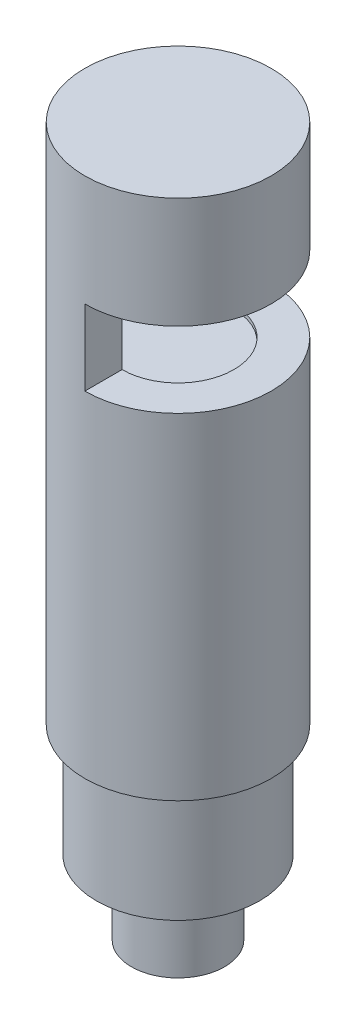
ISO-10303-21;
HEADER;
FILE_DESCRIPTION(('STEP AP214'),'2;1');
FILE_NAME('part.step','',(''),(''),'','','');
FILE_SCHEMA(('AUTOMOTIVE_DESIGN { 1 0 10303 214 1 1 1 1 }'));
ENDSEC;
DATA;
#1=APPLICATION_CONTEXT('core data for automotive mechanical design processes');
#2=APPLICATION_PROTOCOL_DEFINITION('international standard','automotive_design',2000,#1);
#3=PRODUCT_CONTEXT('',#1,'mechanical');
#4=PRODUCT('Part','Part','',(#3));
#5=PRODUCT_RELATED_PRODUCT_CATEGORY('part','',(#4));
#6=PRODUCT_DEFINITION_FORMATION('','',#4);
#7=PRODUCT_DEFINITION_CONTEXT('part definition',#1,'design');
#8=PRODUCT_DEFINITION('design','',#6,#7);
#9=PRODUCT_DEFINITION_SHAPE('','',#8);
#10=(LENGTH_UNIT() NAMED_UNIT(*) SI_UNIT(.MILLI.,.METRE.));
#11=(NAMED_UNIT(*) PLANE_ANGLE_UNIT() SI_UNIT($,.RADIAN.));
#12=(NAMED_UNIT(*) SI_UNIT($,.STERADIAN.) SOLID_ANGLE_UNIT());
#13=UNCERTAINTY_MEASURE_WITH_UNIT(LENGTH_MEASURE(1.E-05),#10,'distance_accuracy_value','');
#14=(GEOMETRIC_REPRESENTATION_CONTEXT(3) GLOBAL_UNCERTAINTY_ASSIGNED_CONTEXT((#13)) GLOBAL_UNIT_ASSIGNED_CONTEXT((#10,
#11,#12)) REPRESENTATION_CONTEXT('',''));
#15=CARTESIAN_POINT('',(0.,0.,0.));
#16=DIRECTION('',(0.,0.,1.));
#17=DIRECTION('',(1.,0.,0.));
#18=AXIS2_PLACEMENT_3D('',#15,#16,#17);
#19=CARTESIAN_POINT('',(0.,-7.61999999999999,0.));
#20=DIRECTION('',(0.,-1.,0.));
#21=DIRECTION('',(0.,0.,-1.));
#22=AXIS2_PLACEMENT_3D('',#19,#20,#21);
#23=PLANE('',#22);
#24=CARTESIAN_POINT('',(0.,-7.61999999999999,0.));
#25=DIRECTION('',(0.,-1.,0.));
#26=DIRECTION('',(0.,0.,-1.));
#27=AXIS2_PLACEMENT_3D('',#24,#25,#26);
#28=CIRCLE('',#27,5.55625);
#29=CARTESIAN_POINT('',(0.,-7.62,5.55625));
#30=VERTEX_POINT('',#29);
#31=EDGE_CURVE('E125',#30,#30,#28,.T.);
#32=ORIENTED_EDGE('',*,*,#31,.T.);
#33=EDGE_LOOP('',(#32));
#34=FACE_BOUND('',#33,.T.);
#35=CARTESIAN_POINT('',(0.,-7.61999999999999,0.));
#36=DIRECTION('',(0.,-1.,0.));
#37=DIRECTION('',(0.,0.,-1.));
#38=AXIS2_PLACEMENT_3D('',#35,#36,#37);
#39=CIRCLE('',#38,3.175);
#40=CARTESIAN_POINT('',(0.,-7.61999999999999,-3.175));
#41=VERTEX_POINT('',#40);
#42=EDGE_CURVE('E131',#41,#41,#39,.T.);
#43=ORIENTED_EDGE('',*,*,#42,.F.);
#44=EDGE_LOOP('',(#43));
#45=FACE_BOUND('',#44,.T.);
#46=ADVANCED_FACE('F35',(#34,#45),#23,.T.);
#47=CARTESIAN_POINT('',(0.,0.,0.));
#48=DIRECTION('',(0.,1.,0.));
#49=DIRECTION('',(0.,0.,1.));
#50=AXIS2_PLACEMENT_3D('',#47,#48,#49);
#51=PLANE('',#50);
#52=CARTESIAN_POINT('',(0.,0.,0.));
#53=DIRECTION('',(0.,1.,0.));
#54=DIRECTION('',(0.,0.,1.));
#55=AXIS2_PLACEMENT_3D('',#52,#53,#54);
#56=CIRCLE('',#55,6.35);
#57=CARTESIAN_POINT('',(0.,0.,6.35));
#58=VERTEX_POINT('',#57);
#59=EDGE_CURVE('E100',#58,#58,#56,.T.);
#60=ORIENTED_EDGE('',*,*,#59,.F.);
#61=EDGE_LOOP('',(#60));
#62=FACE_BOUND('',#61,.T.);
#63=CARTESIAN_POINT('',(0.,0.,0.));
#64=DIRECTION('',(0.,1.,0.));
#65=DIRECTION('',(0.,0.,1.));
#66=AXIS2_PLACEMENT_3D('',#63,#64,#65);
#67=CIRCLE('',#66,5.55625);
#68=CARTESIAN_POINT('',(0.,0.,5.55625));
#69=VERTEX_POINT('',#68);
#70=EDGE_CURVE('E12',#69,#69,#67,.F.);
#71=ORIENTED_EDGE('',*,*,#70,.F.);
#72=EDGE_LOOP('',(#71));
#73=FACE_BOUND('',#72,.T.);
#74=ADVANCED_FACE('F138',(#62,#73),#51,.F.);
#75=CARTESIAN_POINT('',(0.,28.0035,-17.78));
#76=DIRECTION('',(-1.,0.,0.));
#77=DIRECTION('',(0.,-1.,0.));
#78=AXIS2_PLACEMENT_3D('',#75,#76,#77);
#79=PLANE('',#78);
#80=DIRECTION('',(0.,-1.,0.));
#81=VECTOR('',#80,1.);
#82=CARTESIAN_POINT('',(0.,39.287807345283,-3.81));
#83=LINE('',#82,#81);
#84=CARTESIAN_POINT('',(0.,22.86,-3.81));
#85=VERTEX_POINT('',#84);
#86=CARTESIAN_POINT('',(0.,28.0035,-3.81000000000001));
#87=VERTEX_POINT('',#86);
#88=EDGE_CURVE('E76',#85,#87,#83,.F.);
#89=ORIENTED_EDGE('',*,*,#88,.F.);
#90=DIRECTION('',(0.,0.,1.));
#91=VECTOR('',#90,1.);
#92=CARTESIAN_POINT('',(0.,22.86,-17.78));
#93=LINE('',#92,#91);
#94=CARTESIAN_POINT('',(0.,22.86,-6.35));
#95=VERTEX_POINT('',#94);
#96=EDGE_CURVE('E86',#95,#85,#93,.T.);
#97=ORIENTED_EDGE('',*,*,#96,.F.);
#98=DIRECTION('',(0.,-1.,0.));
#99=VECTOR('',#98,1.);
#100=CARTESIAN_POINT('',(0.,35.56,-6.35));
#101=LINE('',#100,#99);
#102=CARTESIAN_POINT('',(0.,28.0035,-6.35000000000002));
#103=VERTEX_POINT('',#102);
#104=EDGE_CURVE('E110',#103,#95,#101,.T.);
#105=ORIENTED_EDGE('',*,*,#104,.F.);
#106=DIRECTION('',(0.,0.,1.));
#107=VECTOR('',#106,1.);
#108=CARTESIAN_POINT('',(0.,28.0035,-17.78));
#109=LINE('',#108,#107);
#110=EDGE_CURVE('E89',#103,#87,#109,.T.);
#111=ORIENTED_EDGE('',*,*,#110,.T.);
#112=EDGE_LOOP('',(#89,#97,#105,#111));
#113=FACE_BOUND('',#112,.T.);
#114=ADVANCED_FACE('F85',(#113),#79,.F.);
#115=DIRECTION('',(0.,-1.,0.));
#116=VECTOR('',#115,1.);
#117=CARTESIAN_POINT('',(0.,39.287807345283,3.81));
#118=LINE('',#117,#116);
#119=CARTESIAN_POINT('',(0.,28.0035,3.80999999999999));
#120=VERTEX_POINT('',#119);
#121=CARTESIAN_POINT('',(0.,22.86,3.81));
#122=VERTEX_POINT('',#121);
#123=EDGE_CURVE('E50',#120,#122,#118,.T.);
#124=ORIENTED_EDGE('',*,*,#123,.F.);
#125=CARTESIAN_POINT('',(0.,28.0035,6.35));
#126=VERTEX_POINT('',#125);
#127=EDGE_CURVE('E57',#120,#126,#109,.T.);
#128=ORIENTED_EDGE('',*,*,#127,.T.);
#129=DIRECTION('',(0.,-1.,0.));
#130=VECTOR('',#129,1.);
#131=CARTESIAN_POINT('',(0.,35.56,6.35000000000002));
#132=LINE('',#131,#130);
#133=CARTESIAN_POINT('',(0.,22.86,6.35000000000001));
#134=VERTEX_POINT('',#133);
#135=EDGE_CURVE('E107',#134,#126,#132,.F.);
#136=ORIENTED_EDGE('',*,*,#135,.F.);
#137=EDGE_CURVE('E95',#122,#134,#93,.T.);
#138=ORIENTED_EDGE('',*,*,#137,.F.);
#139=EDGE_LOOP('',(#124,#128,#136,#138));
#140=FACE_BOUND('',#139,.T.);
#141=ADVANCED_FACE('F167',(#140),#79,.F.);
#142=CARTESIAN_POINT('',(6.35000000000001,28.0035,-17.78));
#143=DIRECTION('',(0.,1.,0.));
#144=DIRECTION('',(0.,0.,1.));
#145=AXIS2_PLACEMENT_3D('',#142,#143,#144);
#146=PLANE('',#145);
#147=CARTESIAN_POINT('',(0.,28.0035,0.));
#148=DIRECTION('',(0.,1.,0.));
#149=DIRECTION('',(0.,0.,1.));
#150=AXIS2_PLACEMENT_3D('',#147,#148,#149);
#151=CIRCLE('',#150,3.81);
#152=EDGE_CURVE('E90',#87,#120,#151,.F.);
#153=ORIENTED_EDGE('',*,*,#152,.F.);
#154=ORIENTED_EDGE('',*,*,#110,.F.);
#155=CARTESIAN_POINT('',(0.,28.0035,0.));
#156=DIRECTION('',(0.,1.,0.));
#157=DIRECTION('',(0.,0.,1.));
#158=AXIS2_PLACEMENT_3D('',#155,#156,#157);
#159=CIRCLE('',#158,6.35);
#160=EDGE_CURVE('E81',#126,#103,#159,.T.);
#161=ORIENTED_EDGE('',*,*,#160,.F.);
#162=ORIENTED_EDGE('',*,*,#127,.F.);
#163=EDGE_LOOP('',(#153,#154,#161,#162));
#164=FACE_BOUND('',#163,.T.);
#165=ADVANCED_FACE('F116',(#164),#146,.F.);
#166=CARTESIAN_POINT('',(6.35000000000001,22.86,-17.78));
#167=DIRECTION('',(0.,-1.,0.));
#168=DIRECTION('',(1.,0.,0.));
#169=AXIS2_PLACEMENT_3D('',#166,#167,#168);
#170=PLANE('',#169);
#171=CARTESIAN_POINT('',(0.,22.86,0.));
#172=DIRECTION('',(0.,-1.,0.));
#173=DIRECTION('',(1.,0.,0.));
#174=AXIS2_PLACEMENT_3D('',#171,#172,#173);
#175=CIRCLE('',#174,3.81);
#176=EDGE_CURVE('E43',#122,#85,#175,.F.);
#177=ORIENTED_EDGE('',*,*,#176,.F.);
#178=ORIENTED_EDGE('',*,*,#137,.T.);
#179=CARTESIAN_POINT('',(0.,22.86,0.));
#180=DIRECTION('',(0.,-1.,0.));
#181=DIRECTION('',(1.,0.,0.));
#182=AXIS2_PLACEMENT_3D('',#179,#180,#181);
#183=CIRCLE('',#182,6.35);
#184=EDGE_CURVE('E94',#95,#134,#183,.T.);
#185=ORIENTED_EDGE('',*,*,#184,.F.);
#186=ORIENTED_EDGE('',*,*,#96,.T.);
#187=EDGE_LOOP('',(#177,#178,#185,#186));
#188=FACE_BOUND('',#187,.T.);
#189=ADVANCED_FACE('F92',(#188),#170,.F.);
#190=CARTESIAN_POINT('',(0.,35.56,0.));
#191=DIRECTION('',(0.,-1.,0.));
#192=DIRECTION('',(0.,0.,-1.));
#193=AXIS2_PLACEMENT_3D('',#190,#191,#192);
#194=CYLINDRICAL_SURFACE('',#193,6.35);
#195=ORIENTED_EDGE('',*,*,#135,.T.);
#196=ORIENTED_EDGE('',*,*,#160,.T.);
#197=ORIENTED_EDGE('',*,*,#104,.T.);
#198=ORIENTED_EDGE('',*,*,#184,.T.);
#199=EDGE_LOOP('',(#195,#196,#197,#198));
#200=FACE_BOUND('',#199,.T.);
#201=CARTESIAN_POINT('',(0.,35.56,0.));
#202=DIRECTION('',(0.,1.,0.));
#203=DIRECTION('',(0.,0.,1.));
#204=AXIS2_PLACEMENT_3D('',#201,#202,#203);
#205=CIRCLE('',#204,6.35);
#206=CARTESIAN_POINT('',(0.,35.56,6.35000000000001));
#207=VERTEX_POINT('',#206);
#208=EDGE_CURVE('E103',#207,#207,#205,.T.);
#209=ORIENTED_EDGE('',*,*,#208,.F.);
#210=EDGE_LOOP('',(#209));
#211=FACE_BOUND('',#210,.T.);
#212=ORIENTED_EDGE('',*,*,#59,.T.);
#213=EDGE_LOOP('',(#212));
#214=FACE_BOUND('',#213,.T.);
#215=ADVANCED_FACE('F37',(#200,#211,#214),#194,.T.);
#216=CARTESIAN_POINT('',(0.,35.56,0.));
#217=DIRECTION('',(0.,1.,0.));
#218=DIRECTION('',(0.,0.,1.));
#219=AXIS2_PLACEMENT_3D('',#216,#217,#218);
#220=PLANE('',#219);
#221=ORIENTED_EDGE('',*,*,#208,.T.);
#222=EDGE_LOOP('',(#221));
#223=FACE_BOUND('',#222,.T.);
#224=ADVANCED_FACE('F160',(#223),#220,.T.);
#225=CARTESIAN_POINT('',(0.,39.287807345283,0.));
#226=DIRECTION('',(0.,-1.,0.));
#227=DIRECTION('',(1.,0.,0.));
#228=AXIS2_PLACEMENT_3D('',#225,#226,#227);
#229=CYLINDRICAL_SURFACE('',#228,3.81);
#230=CARTESIAN_POINT('',(0.,22.606,0.));
#231=DIRECTION('',(0.,1.,0.));
#232=DIRECTION('',(-1.,0.,0.));
#233=AXIS2_PLACEMENT_3D('',#230,#231,#232);
#234=CIRCLE('',#233,3.81);
#235=CARTESIAN_POINT('',(-3.81,22.606,0.));
#236=VERTEX_POINT('',#235);
#237=EDGE_CURVE('E122',#236,#236,#234,.T.);
#238=ORIENTED_EDGE('',*,*,#237,.F.);
#239=EDGE_LOOP('',(#238));
#240=FACE_BOUND('',#239,.T.);
#241=CARTESIAN_POINT('',(0.,28.2575,0.));
#242=DIRECTION('',(0.,1.,0.));
#243=DIRECTION('',(0.,0.,1.));
#244=AXIS2_PLACEMENT_3D('',#241,#242,#243);
#245=CIRCLE('',#244,3.81);
#246=CARTESIAN_POINT('',(0.,28.2575,3.81000000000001));
#247=VERTEX_POINT('',#246);
#248=EDGE_CURVE('E119',#247,#247,#245,.T.);
#249=ORIENTED_EDGE('',*,*,#248,.T.);
#250=EDGE_LOOP('',(#249));
#251=FACE_BOUND('',#250,.T.);
#252=ORIENTED_EDGE('',*,*,#152,.T.);
#253=ORIENTED_EDGE('',*,*,#123,.T.);
#254=ORIENTED_EDGE('',*,*,#176,.T.);
#255=ORIENTED_EDGE('',*,*,#88,.T.);
#256=EDGE_LOOP('',(#252,#253,#254,#255));
#257=FACE_BOUND('',#256,.T.);
#258=ADVANCED_FACE('F75',(#240,#251,#257),#229,.F.);
#259=CARTESIAN_POINT('',(6.35000000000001,28.2575,-17.78));
#260=DIRECTION('',(0.,1.,0.));
#261=DIRECTION('',(0.,0.,1.));
#262=AXIS2_PLACEMENT_3D('',#259,#260,#261);
#263=PLANE('',#262);
#264=ORIENTED_EDGE('',*,*,#248,.F.);
#265=EDGE_LOOP('',(#264));
#266=FACE_BOUND('',#265,.T.);
#267=ADVANCED_FACE('F156',(#266),#263,.F.);
#268=CARTESIAN_POINT('',(0.,22.606,0.));
#269=DIRECTION('',(0.,1.,0.));
#270=DIRECTION('',(-1.,0.,0.));
#271=AXIS2_PLACEMENT_3D('',#268,#269,#270);
#272=PLANE('',#271);
#273=ORIENTED_EDGE('',*,*,#237,.T.);
#274=EDGE_LOOP('',(#273));
#275=FACE_BOUND('',#274,.T.);
#276=ADVANCED_FACE('F152',(#275),#272,.T.);
#277=CARTESIAN_POINT('',(0.,-7.61999999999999,0.));
#278=DIRECTION('',(0.,1.,0.));
#279=DIRECTION('',(0.,0.,1.));
#280=AXIS2_PLACEMENT_3D('',#277,#278,#279);
#281=CYLINDRICAL_SURFACE('',#280,5.55625);
#282=CARTESIAN_POINT('',(0.,-7.62,5.55625));
#283=CARTESIAN_POINT('',(0.,-7.540625,5.55625));
#284=CARTESIAN_POINT('',(0.,-7.46125,5.55625));
#285=CARTESIAN_POINT('',(0.,-7.3025,5.55625));
#286=CARTESIAN_POINT('',(0.,-7.223125,5.55625));
#287=CARTESIAN_POINT('',(0.,-7.064375,5.55625));
#288=CARTESIAN_POINT('',(0.,-6.985,5.55625));
#289=CARTESIAN_POINT('',(0.,-6.82625,5.55625));
#290=CARTESIAN_POINT('',(0.,-6.746875,5.55625));
#291=CARTESIAN_POINT('',(0.,-6.588125,5.55625));
#292=CARTESIAN_POINT('',(0.,-6.50875,5.55625));
#293=CARTESIAN_POINT('',(0.,-6.35,5.55625));
#294=CARTESIAN_POINT('',(0.,-6.270625,5.55625));
#295=CARTESIAN_POINT('',(0.,-6.111875,5.55625));
#296=CARTESIAN_POINT('',(0.,-6.0325,5.55625));
#297=CARTESIAN_POINT('',(0.,-5.87375,5.55625));
#298=CARTESIAN_POINT('',(0.,-5.794375,5.55625));
#299=CARTESIAN_POINT('',(0.,-5.635625,5.55625));
#300=CARTESIAN_POINT('',(0.,-5.55625,5.55625));
#301=CARTESIAN_POINT('',(0.,-5.3975,5.55625));
#302=CARTESIAN_POINT('',(0.,-5.318125,5.55625));
#303=CARTESIAN_POINT('',(0.,-5.159375,5.55625));
#304=CARTESIAN_POINT('',(0.,-5.08,5.55625));
#305=CARTESIAN_POINT('',(0.,-4.92125,5.55625));
#306=CARTESIAN_POINT('',(0.,-4.841875,5.55625));
#307=CARTESIAN_POINT('',(0.,-4.683125,5.55625));
#308=CARTESIAN_POINT('',(0.,-4.60375,5.55625));
#309=CARTESIAN_POINT('',(0.,-4.445,5.55625));
#310=CARTESIAN_POINT('',(0.,-4.365625,5.55625));
#311=CARTESIAN_POINT('',(0.,-4.206875,5.55625));
#312=CARTESIAN_POINT('',(0.,-4.1275,5.55625));
#313=CARTESIAN_POINT('',(0.,-3.96875,5.55625));
#314=CARTESIAN_POINT('',(0.,-3.889375,5.55625));
#315=CARTESIAN_POINT('',(0.,-3.730625,5.55625));
#316=CARTESIAN_POINT('',(0.,-3.65125,5.55625));
#317=CARTESIAN_POINT('',(0.,-3.4925,5.55625));
#318=CARTESIAN_POINT('',(0.,-3.413125,5.55625));
#319=CARTESIAN_POINT('',(0.,-3.254375,5.55625));
#320=CARTESIAN_POINT('',(0.,-3.175,5.55625));
#321=CARTESIAN_POINT('',(0.,-3.01625,5.55625));
#322=CARTESIAN_POINT('',(0.,-2.936875,5.55625));
#323=CARTESIAN_POINT('',(0.,-2.778125,5.55625));
#324=CARTESIAN_POINT('',(0.,-2.69875,5.55625));
#325=CARTESIAN_POINT('',(0.,-2.54,5.55625));
#326=CARTESIAN_POINT('',(0.,-2.460625,5.55625));
#327=CARTESIAN_POINT('',(0.,-2.301875,5.55625));
#328=CARTESIAN_POINT('',(0.,-2.2225,5.55625));
#329=CARTESIAN_POINT('',(0.,-2.06375,5.55625));
#330=CARTESIAN_POINT('',(0.,-1.984375,5.55625));
#331=CARTESIAN_POINT('',(0.,-1.825625,5.55625));
#332=CARTESIAN_POINT('',(0.,-1.74625,5.55625));
#333=CARTESIAN_POINT('',(0.,-1.5875,5.55625));
#334=CARTESIAN_POINT('',(0.,-1.508125,5.55625));
#335=CARTESIAN_POINT('',(0.,-1.349375,5.55625));
#336=CARTESIAN_POINT('',(0.,-1.27,5.55625));
#337=CARTESIAN_POINT('',(0.,-1.11125,5.55625));
#338=CARTESIAN_POINT('',(0.,-1.031875,5.55625));
#339=CARTESIAN_POINT('',(0.,-0.873125,5.55625));
#340=CARTESIAN_POINT('',(0.,-0.79375,5.55625));
#341=CARTESIAN_POINT('',(0.,-0.635000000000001,5.55625));
#342=CARTESIAN_POINT('',(0.,-0.555625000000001,5.55625));
#343=CARTESIAN_POINT('',(0.,-0.396875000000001,5.55625));
#344=CARTESIAN_POINT('',(0.,-0.317500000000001,5.55625));
#345=CARTESIAN_POINT('',(0.,-0.158750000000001,5.55625));
#346=CARTESIAN_POINT('',(0.,-0.0793750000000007,5.55625));
#347=CARTESIAN_POINT('',(0.,0.,5.55625));
#348=B_SPLINE_CURVE_WITH_KNOTS('',3,(#282,#283,#284,#285,#286,#287,#288,#289,#290,#291,#292,
#293,#294,#295,#296,#297,#298,#299,#300,#301,#302,#303,#304,#305,#306,#307,#308,#309,#310,#311,
#312,#313,#314,#315,#316,#317,#318,#319,#320,#321,#322,#323,#324,#325,#326,#327,#328,#329,#330,
#331,#332,#333,#334,#335,#336,#337,#338,#339,#340,#341,#342,#343,#344,#345,#346,#347),
.UNSPECIFIED.,.F.,.F.,(4,2,2,2,2,2,2,2,2,2,2,2,2,2,2,2,2,2,2,2,2,2,2,2,2,2,2,2,2,2,2,2,4),(0.,
0.238125,0.476249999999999,0.714374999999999,0.952499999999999,1.190625,1.42875,1.666875,1.905,
2.143125,2.38125,2.619375,2.8575,3.095625,3.33375,3.571875,3.81,4.048125,4.28625,4.524375,
4.7625,5.000625,5.23875,5.476875,5.715,5.953125,6.19125,6.42937499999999,6.6675,6.905625,
7.14374999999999,7.381875,7.61999999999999),.UNSPECIFIED.);
#349=EDGE_CURVE('BSEAM149',#30,#69,#348,.T.);
#350=ORIENTED_EDGE('',*,*,#31,.F.);
#351=ORIENTED_EDGE('',*,*,#70,.T.);
#352=ORIENTED_EDGE('',*,*,#349,.T.);
#353=ORIENTED_EDGE('',*,*,#349,.F.);
#354=EDGE_LOOP('',(#350,#352,#351,#353));
#355=FACE_BOUND('',#354,.T.);
#356=ADVANCED_FACE('F149',(#355),#281,.T.);
#357=CARTESIAN_POINT('',(0.,-12.7,0.));
#358=DIRECTION('',(0.,1.,0.));
#359=DIRECTION('',(0.,0.,1.));
#360=AXIS2_PLACEMENT_3D('',#357,#358,#359);
#361=CYLINDRICAL_SURFACE('',#360,3.175);
#362=CARTESIAN_POINT('',(0.,-12.7,0.));
#363=DIRECTION('',(0.,-1.,0.));
#364=DIRECTION('',(0.,0.,-1.));
#365=AXIS2_PLACEMENT_3D('',#362,#363,#364);
#366=CIRCLE('',#365,3.175);
#367=CARTESIAN_POINT('',(0.,-12.7,-3.17500000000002));
#368=VERTEX_POINT('',#367);
#369=EDGE_CURVE('E128',#368,#368,#366,.T.);
#370=ORIENTED_EDGE('',*,*,#369,.F.);
#371=EDGE_LOOP('',(#370));
#372=FACE_BOUND('',#371,.T.);
#373=ORIENTED_EDGE('',*,*,#42,.T.);
#374=EDGE_LOOP('',(#373));
#375=FACE_BOUND('',#374,.T.);
#376=ADVANCED_FACE('F135',(#372,#375),#361,.T.);
#377=CARTESIAN_POINT('',(0.,-12.7,0.));
#378=DIRECTION('',(0.,-1.,0.));
#379=DIRECTION('',(0.,0.,-1.));
#380=AXIS2_PLACEMENT_3D('',#377,#378,#379);
#381=PLANE('',#380);
#382=ORIENTED_EDGE('',*,*,#369,.T.);
#383=EDGE_LOOP('',(#382));
#384=FACE_BOUND('',#383,.T.);
#385=ADVANCED_FACE('F223',(#384),#381,.T.);
#386=CLOSED_SHELL('',(#46,#74,#114,#141,#165,#189,#215,#224,#258,#267,#276,#356,#376,#385));
#387=MANIFOLD_SOLID_BREP('B2',#386);
#388=ADVANCED_BREP_SHAPE_REPRESENTATION('',(#18,#387),#14);
#389=SHAPE_DEFINITION_REPRESENTATION(#9,#388);
ENDSEC;
END-ISO-10303-21;
